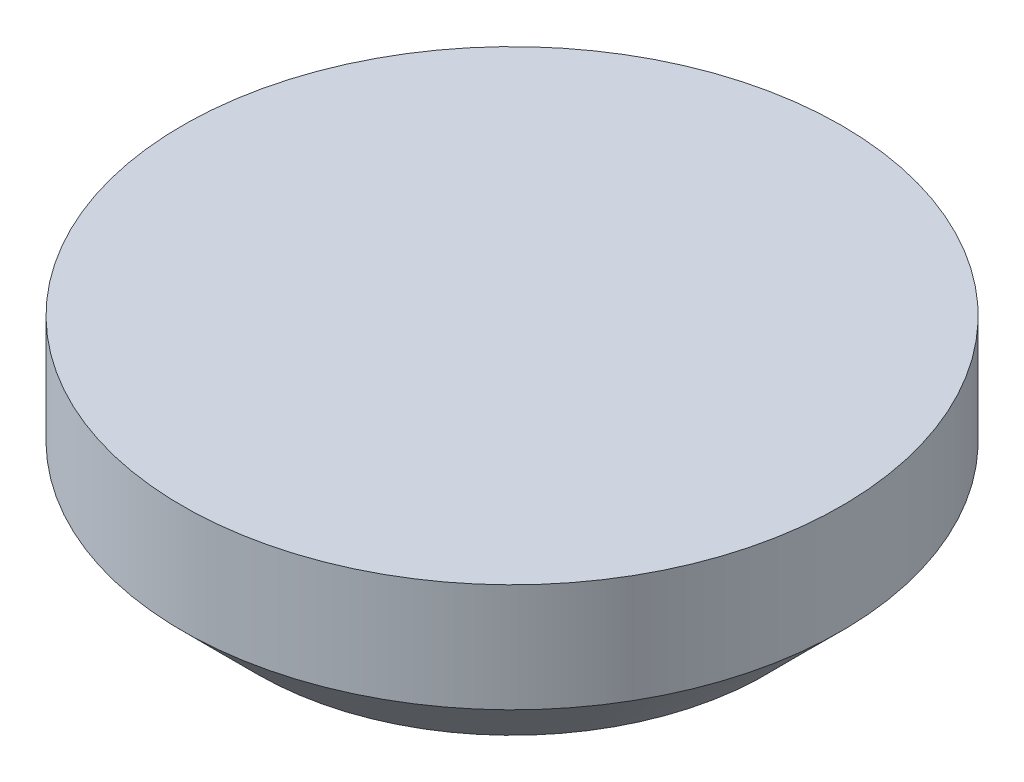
ISO-10303-21;
HEADER;
FILE_DESCRIPTION(('STEP AP214'),'2;1');
FILE_NAME('part.step','',(''),(''),'','','');
FILE_SCHEMA(('AUTOMOTIVE_DESIGN { 1 0 10303 214 1 1 1 1 }'));
ENDSEC;
DATA;
#1=APPLICATION_CONTEXT('core data for automotive mechanical design processes');
#2=APPLICATION_PROTOCOL_DEFINITION('international standard','automotive_design',2000,#1);
#3=PRODUCT_CONTEXT('',#1,'mechanical');
#4=PRODUCT('Part','Part','',(#3));
#5=PRODUCT_RELATED_PRODUCT_CATEGORY('part','',(#4));
#6=PRODUCT_DEFINITION_FORMATION('','',#4);
#7=PRODUCT_DEFINITION_CONTEXT('part definition',#1,'design');
#8=PRODUCT_DEFINITION('design','',#6,#7);
#9=PRODUCT_DEFINITION_SHAPE('','',#8);
#10=(LENGTH_UNIT() NAMED_UNIT(*) SI_UNIT(.MILLI.,.METRE.));
#11=(NAMED_UNIT(*) PLANE_ANGLE_UNIT() SI_UNIT($,.RADIAN.));
#12=(NAMED_UNIT(*) SI_UNIT($,.STERADIAN.) SOLID_ANGLE_UNIT());
#13=UNCERTAINTY_MEASURE_WITH_UNIT(LENGTH_MEASURE(1.E-05),#10,'distance_accuracy_value','');
#14=(GEOMETRIC_REPRESENTATION_CONTEXT(3) GLOBAL_UNCERTAINTY_ASSIGNED_CONTEXT((#13)) GLOBAL_UNIT_ASSIGNED_CONTEXT((#10,
#11,#12)) REPRESENTATION_CONTEXT('',''));
#15=CARTESIAN_POINT('',(0.,0.,0.));
#16=DIRECTION('',(0.,0.,1.));
#17=DIRECTION('',(1.,0.,0.));
#18=AXIS2_PLACEMENT_3D('',#15,#16,#17);
#19=CARTESIAN_POINT('',(0.,390.,0.));
#20=DIRECTION('',(0.,1.,0.));
#21=DIRECTION('',(0.,0.,1.));
#22=AXIS2_PLACEMENT_3D('',#19,#20,#21);
#23=PLANE('',#22);
#24=CARTESIAN_POINT('',(0.,390.,0.));
#25=DIRECTION('',(0.,-1.,0.));
#26=DIRECTION('',(0.,0.,-1.));
#27=AXIS2_PLACEMENT_3D('',#24,#25,#26);
#28=CIRCLE('',#27,700.);
#29=CARTESIAN_POINT('',(0.,390.,-700.));
#30=VERTEX_POINT('',#29);
#31=EDGE_CURVE('E12',#30,#30,#28,.T.);
#32=ORIENTED_EDGE('',*,*,#31,.F.);
#33=EDGE_LOOP('',(#32));
#34=FACE_BOUND('',#33,.T.);
#35=ADVANCED_FACE('F45',(#34),#23,.T.);
#36=CARTESIAN_POINT('',(0.,0.,0.));
#37=DIRECTION('',(0.,-1.,0.));
#38=DIRECTION('',(0.,0.,-1.));
#39=AXIS2_PLACEMENT_3D('',#36,#37,#38);
#40=CYLINDRICAL_SURFACE('',#39,700.);
#41=ORIENTED_EDGE('',*,*,#31,.T.);
#42=EDGE_LOOP('',(#41));
#43=FACE_BOUND('',#42,.T.);
#44=CARTESIAN_POINT('',(0.,160.,0.));
#45=DIRECTION('',(0.,-1.,0.));
#46=DIRECTION('',(0.,0.,-1.));
#47=AXIS2_PLACEMENT_3D('',#44,#45,#46);
#48=CIRCLE('',#47,700.);
#49=CARTESIAN_POINT('',(0.,160.,-700.));
#50=VERTEX_POINT('',#49);
#51=EDGE_CURVE('E52',#50,#50,#48,.T.);
#52=ORIENTED_EDGE('',*,*,#51,.F.);
#53=EDGE_LOOP('',(#52));
#54=FACE_BOUND('',#53,.T.);
#55=ADVANCED_FACE('F69',(#43,#54),#40,.T.);
#56=CARTESIAN_POINT('',(0.,0.,0.));
#57=DIRECTION('',(0.,1.,0.));
#58=DIRECTION('',(0.,0.,1.));
#59=AXIS2_PLACEMENT_3D('',#56,#57,#58);
#60=CONICAL_SURFACE('',#59,540.,0.785398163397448);
#61=ORIENTED_EDGE('',*,*,#51,.T.);
#62=EDGE_LOOP('',(#61));
#63=FACE_BOUND('',#62,.T.);
#64=CARTESIAN_POINT('',(0.,0.,0.));
#65=DIRECTION('',(0.,-1.,0.));
#66=DIRECTION('',(0.,0.,-1.));
#67=AXIS2_PLACEMENT_3D('',#64,#65,#66);
#68=CIRCLE('',#67,540.);
#69=CARTESIAN_POINT('',(0.,0.,-540.));
#70=VERTEX_POINT('',#69);
#71=EDGE_CURVE('E57',#70,#70,#68,.T.);
#72=ORIENTED_EDGE('',*,*,#71,.F.);
#73=EDGE_LOOP('',(#72));
#74=FACE_BOUND('',#73,.T.);
#75=ADVANCED_FACE('F67',(#63,#74),#60,.T.);
#76=CARTESIAN_POINT('',(540.,0.,0.));
#77=DIRECTION('',(0.,-1.,0.));
#78=DIRECTION('',(0.,0.,-1.));
#79=AXIS2_PLACEMENT_3D('',#76,#77,#78);
#80=PLANE('',#79);
#81=ORIENTED_EDGE('',*,*,#71,.T.);
#82=EDGE_LOOP('',(#81));
#83=FACE_BOUND('',#82,.T.);
#84=ADVANCED_FACE('F65',(#83),#80,.T.);
#85=CLOSED_SHELL('',(#35,#55,#75,#84));
#86=MANIFOLD_SOLID_BREP('B2',#85);
#87=ADVANCED_BREP_SHAPE_REPRESENTATION('',(#18,#86),#14);
#88=SHAPE_DEFINITION_REPRESENTATION(#9,#87);
ENDSEC;
END-ISO-10303-21;
